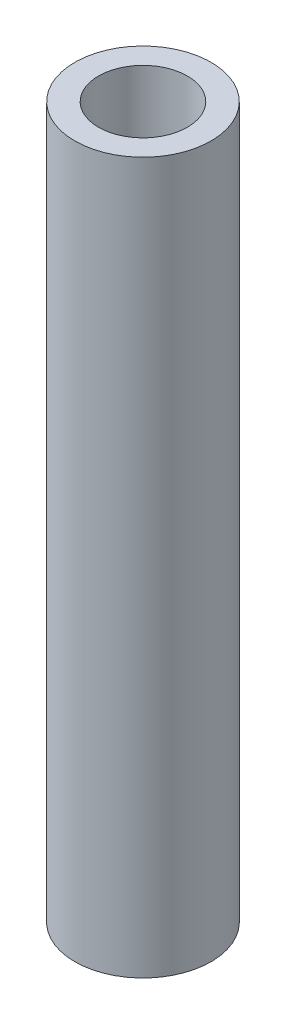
from build123d import *

# Parameters (mm, degrees)
SKETCH1_R           = 2.874999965
SKETCH1_R_2         = 1.87500006
BOSS_EXTRUDE1_DEPTH = 30


with BuildPart() as part:
    # Sketch1 → Boss-Extrude1 (new body)
    with BuildSketch(Plane(origin=(0, 0, 0), x_dir=(1, 0, 0), z_dir=(0, 1, 0))):
        with Locations(Location((0, 0, 0), (0, 0, 270))):
            Circle(SKETCH1_R)
        with Locations(Location((0, 0, 0), (0, 0, 270))):
            Circle(SKETCH1_R_2, mode=Mode.SUBTRACT)
    extrude(amount=BOSS_EXTRUDE1_DEPTH)


solid = part.part
